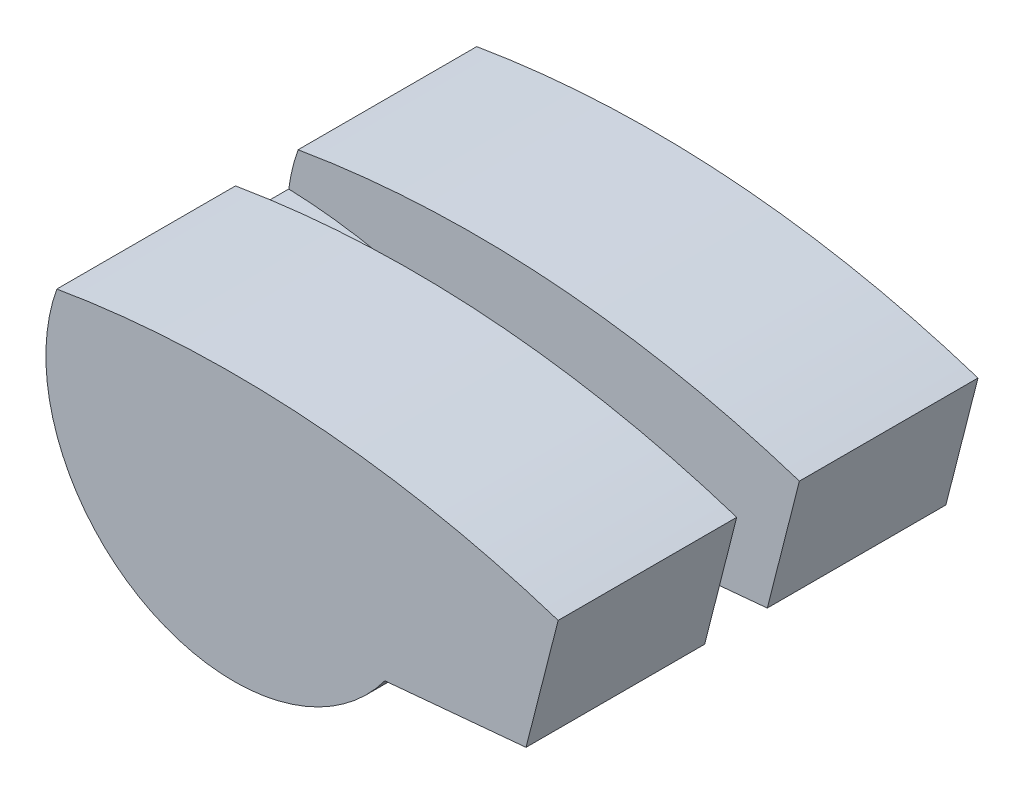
ISO-10303-21;
HEADER;
FILE_DESCRIPTION(('STEP AP214'),'2;1');
FILE_NAME('part.step','',(''),(''),'','','');
FILE_SCHEMA(('AUTOMOTIVE_DESIGN { 1 0 10303 214 1 1 1 1 }'));
ENDSEC;
DATA;
#1=APPLICATION_CONTEXT('core data for automotive mechanical design processes');
#2=APPLICATION_PROTOCOL_DEFINITION('international standard','automotive_design',2000,#1);
#3=PRODUCT_CONTEXT('',#1,'mechanical');
#4=PRODUCT('Part','Part','',(#3));
#5=PRODUCT_RELATED_PRODUCT_CATEGORY('part','',(#4));
#6=PRODUCT_DEFINITION_FORMATION('','',#4);
#7=PRODUCT_DEFINITION_CONTEXT('part definition',#1,'design');
#8=PRODUCT_DEFINITION('design','',#6,#7);
#9=PRODUCT_DEFINITION_SHAPE('','',#8);
#10=(LENGTH_UNIT() NAMED_UNIT(*) SI_UNIT(.MILLI.,.METRE.));
#11=(NAMED_UNIT(*) PLANE_ANGLE_UNIT() SI_UNIT($,.RADIAN.));
#12=(NAMED_UNIT(*) SI_UNIT($,.STERADIAN.) SOLID_ANGLE_UNIT());
#13=UNCERTAINTY_MEASURE_WITH_UNIT(LENGTH_MEASURE(1.E-05),#10,'distance_accuracy_value','');
#14=(GEOMETRIC_REPRESENTATION_CONTEXT(3) GLOBAL_UNCERTAINTY_ASSIGNED_CONTEXT((#13)) GLOBAL_UNIT_ASSIGNED_CONTEXT((#10,
#11,#12)) REPRESENTATION_CONTEXT('',''));
#15=CARTESIAN_POINT('',(0.,0.,0.));
#16=DIRECTION('',(0.,0.,1.));
#17=DIRECTION('',(1.,0.,0.));
#18=AXIS2_PLACEMENT_3D('',#15,#16,#17);
#19=CARTESIAN_POINT('',(0.,0.,3.35));
#20=DIRECTION('',(0.,0.,-1.));
#21=DIRECTION('',(-1.,0.,0.));
#22=AXIS2_PLACEMENT_3D('',#19,#20,#21);
#23=CYLINDRICAL_SURFACE('',#22,3.00000000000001);
#24=CARTESIAN_POINT('',(0.,0.,-0.5));
#25=DIRECTION('',(0.,0.,1.));
#26=DIRECTION('',(1.,0.,0.));
#27=AXIS2_PLACEMENT_3D('',#24,#25,#26);
#28=CIRCLE('',#27,3.00000000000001);
#29=CARTESIAN_POINT('',(-2.82484284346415,1.0100806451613,-0.5));
#30=VERTEX_POINT('',#29);
#31=CARTESIAN_POINT('',(-2.97415390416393,0.392948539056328,-0.5));
#32=VERTEX_POINT('',#31);
#33=EDGE_CURVE('E485',#30,#32,#28,.T.);
#34=ORIENTED_EDGE('',*,*,#33,.F.);
#35=DIRECTION('',(0.,0.,-1.));
#36=VECTOR('',#35,1.);
#37=CARTESIAN_POINT('',(-2.82484284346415,1.01008064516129,3.35));
#38=LINE('',#37,#36);
#39=CARTESIAN_POINT('',(-2.82484284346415,1.01008064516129,-3.35));
#40=VERTEX_POINT('',#39);
#41=EDGE_CURVE('E466',#30,#40,#38,.T.);
#42=ORIENTED_EDGE('',*,*,#41,.T.);
#43=CARTESIAN_POINT('',(0.,0.,-3.35));
#44=DIRECTION('',(0.,0.,1.));
#45=DIRECTION('',(1.,0.,0.));
#46=AXIS2_PLACEMENT_3D('',#43,#44,#45);
#47=CIRCLE('',#46,3.00000000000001);
#48=CARTESIAN_POINT('',(2.40937388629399,-1.78743320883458,-3.35));
#49=VERTEX_POINT('',#48);
#50=EDGE_CURVE('E482',#40,#49,#47,.T.);
#51=ORIENTED_EDGE('',*,*,#50,.T.);
#52=DIRECTION('',(0.,0.,-1.));
#53=VECTOR('',#52,1.);
#54=CARTESIAN_POINT('',(2.40937388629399,-1.78743320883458,3.35));
#55=LINE('',#54,#53);
#56=CARTESIAN_POINT('',(2.40937388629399,-1.78743320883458,-0.5));
#57=VERTEX_POINT('',#56);
#58=EDGE_CURVE('E449',#57,#49,#55,.T.);
#59=ORIENTED_EDGE('',*,*,#58,.F.);
#60=DIRECTION('',(0.,0.,1.));
#61=VECTOR('',#60,1.);
#62=CARTESIAN_POINT('',(2.40937388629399,-1.78743320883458,-0.5));
#63=LINE('',#62,#61);
#64=CARTESIAN_POINT('',(2.40937388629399,-1.78743320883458,0.5));
#65=VERTEX_POINT('',#64);
#66=EDGE_CURVE('E426',#57,#65,#63,.T.);
#67=ORIENTED_EDGE('',*,*,#66,.T.);
#68=CARTESIAN_POINT('',(2.40937388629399,-1.78743320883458,3.35));
#69=VERTEX_POINT('',#68);
#70=EDGE_CURVE('E447',#69,#65,#55,.T.);
#71=ORIENTED_EDGE('',*,*,#70,.F.);
#72=CARTESIAN_POINT('',(0.,0.,3.35));
#73=DIRECTION('',(0.,0.,1.));
#74=DIRECTION('',(1.,0.,0.));
#75=AXIS2_PLACEMENT_3D('',#72,#73,#74);
#76=CIRCLE('',#75,3.00000000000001);
#77=CARTESIAN_POINT('',(-2.82484284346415,1.01008064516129,3.35));
#78=VERTEX_POINT('',#77);
#79=EDGE_CURVE('E471',#78,#69,#76,.T.);
#80=ORIENTED_EDGE('',*,*,#79,.F.);
#81=CARTESIAN_POINT('',(-2.82484284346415,1.01008064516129,0.5));
#82=VERTEX_POINT('',#81);
#83=EDGE_CURVE('E463',#78,#82,#38,.T.);
#84=ORIENTED_EDGE('',*,*,#83,.T.);
#85=CARTESIAN_POINT('',(0.,0.,0.5));
#86=DIRECTION('',(0.,0.,1.));
#87=DIRECTION('',(1.,0.,0.));
#88=AXIS2_PLACEMENT_3D('',#85,#86,#87);
#89=CIRCLE('',#88,3.00000000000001);
#90=CARTESIAN_POINT('',(-2.97415390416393,0.392948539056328,0.5));
#91=VERTEX_POINT('',#90);
#92=EDGE_CURVE('E365',#82,#91,#89,.T.);
#93=ORIENTED_EDGE('',*,*,#92,.T.);
#94=DIRECTION('',(0.,0.,1.));
#95=VECTOR('',#94,1.);
#96=CARTESIAN_POINT('',(-2.97415390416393,0.392948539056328,0.));
#97=LINE('',#96,#95);
#98=EDGE_CURVE('E429',#91,#32,#97,.F.);
#99=ORIENTED_EDGE('',*,*,#98,.T.);
#100=EDGE_LOOP('',(#34,#42,#51,#59,#67,#71,#80,#84,#93,#99));
#101=FACE_BOUND('',#100,.T.);
#102=ADVANCED_FACE('F351',(#101),#23,.T.);
#103=CARTESIAN_POINT('',(2.40937388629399,-1.78743320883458,3.35));
#104=DIRECTION('',(-0.0912073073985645,0.995831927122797,0.));
#105=DIRECTION('',(-0.995831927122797,-0.0912073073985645,0.));
#106=AXIS2_PLACEMENT_3D('',#103,#104,#105);
#107=PLANE('',#106);
#108=DIRECTION('',(0.995831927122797,0.0912073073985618,0.));
#109=VECTOR('',#108,1.);
#110=CARTESIAN_POINT('',(2.40937388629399,-1.78743320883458,-0.5));
#111=LINE('',#110,#109);
#112=CARTESIAN_POINT('',(4.66246004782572,-1.58107517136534,-0.5));
#113=VERTEX_POINT('',#112);
#114=EDGE_CURVE('E450',#57,#113,#111,.T.);
#115=ORIENTED_EDGE('',*,*,#114,.F.);
#116=ORIENTED_EDGE('',*,*,#58,.T.);
#117=DIRECTION('',(0.995831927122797,0.0912073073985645,0.));
#118=VECTOR('',#117,1.);
#119=CARTESIAN_POINT('',(2.40937388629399,-1.78743320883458,-3.35));
#120=LINE('',#119,#118);
#121=CARTESIAN_POINT('',(4.66246004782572,-1.58107517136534,-3.35));
#122=VERTEX_POINT('',#121);
#123=EDGE_CURVE('E479',#49,#122,#120,.T.);
#124=ORIENTED_EDGE('',*,*,#123,.T.);
#125=DIRECTION('',(0.,0.,-1.));
#126=VECTOR('',#125,1.);
#127=CARTESIAN_POINT('',(4.66246004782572,-1.58107517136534,3.35));
#128=LINE('',#127,#126);
#129=EDGE_CURVE('E458',#113,#122,#128,.T.);
#130=ORIENTED_EDGE('',*,*,#129,.F.);
#131=EDGE_LOOP('',(#115,#116,#124,#130));
#132=FACE_BOUND('',#131,.T.);
#133=ADVANCED_FACE('F515',(#132),#107,.F.);
#134=CARTESIAN_POINT('',(4.66246004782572,-1.58107517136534,3.35));
#135=DIRECTION('',(-0.969020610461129,0.246979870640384,0.));
#136=DIRECTION('',(-0.246979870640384,-0.969020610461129,0.));
#137=AXIS2_PLACEMENT_3D('',#134,#135,#136);
#138=PLANE('',#137);
#139=DIRECTION('',(0.246979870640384,0.969020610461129,0.));
#140=VECTOR('',#139,1.);
#141=CARTESIAN_POINT('',(4.66246004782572,-1.58107517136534,-0.5));
#142=LINE('',#141,#140);
#143=CARTESIAN_POINT('',(5.17515715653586,0.4304817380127,-0.5));
#144=VERTEX_POINT('',#143);
#145=EDGE_CURVE('E487',#113,#144,#142,.T.);
#146=ORIENTED_EDGE('',*,*,#145,.F.);
#147=ORIENTED_EDGE('',*,*,#129,.T.);
#148=DIRECTION('',(0.246979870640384,0.969020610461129,0.));
#149=VECTOR('',#148,1.);
#150=CARTESIAN_POINT('',(4.66246004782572,-1.58107517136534,-3.35));
#151=LINE('',#150,#149);
#152=CARTESIAN_POINT('',(5.17515715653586,0.430481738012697,-3.35));
#153=VERTEX_POINT('',#152);
#154=EDGE_CURVE('E476',#122,#153,#151,.T.);
#155=ORIENTED_EDGE('',*,*,#154,.T.);
#156=DIRECTION('',(0.,0.,-1.));
#157=VECTOR('',#156,1.);
#158=CARTESIAN_POINT('',(5.17515715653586,0.430481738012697,3.35));
#159=LINE('',#158,#157);
#160=EDGE_CURVE('E462',#144,#153,#159,.T.);
#161=ORIENTED_EDGE('',*,*,#160,.F.);
#162=EDGE_LOOP('',(#146,#147,#155,#161));
#163=FACE_BOUND('',#162,.T.);
#164=ADVANCED_FACE('F519',(#163),#138,.F.);
#165=CARTESIAN_POINT('',(0.,-15.5,3.35));
#166=DIRECTION('',(0.,0.,-1.));
#167=DIRECTION('',(-1.,0.,0.));
#168=AXIS2_PLACEMENT_3D('',#165,#166,#167);
#169=CYLINDRICAL_SURFACE('',#168,16.75);
#170=CARTESIAN_POINT('',(0.,-15.5,-0.5));
#171=DIRECTION('',(0.,0.,1.));
#172=DIRECTION('',(1.,0.,0.));
#173=AXIS2_PLACEMENT_3D('',#170,#171,#172);
#174=CIRCLE('',#173,16.75);
#175=EDGE_CURVE('E11',#144,#30,#174,.T.);
#176=ORIENTED_EDGE('',*,*,#175,.F.);
#177=ORIENTED_EDGE('',*,*,#160,.T.);
#178=CARTESIAN_POINT('',(0.,-15.5,-3.35));
#179=DIRECTION('',(0.,0.,1.));
#180=DIRECTION('',(1.,0.,0.));
#181=AXIS2_PLACEMENT_3D('',#178,#179,#180);
#182=CIRCLE('',#181,16.75);
#183=EDGE_CURVE('E473',#153,#40,#182,.T.);
#184=ORIENTED_EDGE('',*,*,#183,.T.);
#185=ORIENTED_EDGE('',*,*,#41,.F.);
#186=EDGE_LOOP('',(#176,#177,#184,#185));
#187=FACE_BOUND('',#186,.T.);
#188=ADVANCED_FACE('F513',(#187),#169,.T.);
#189=ORIENTED_EDGE('',*,*,#70,.T.);
#190=DIRECTION('',(0.995831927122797,0.0912073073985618,0.));
#191=VECTOR('',#190,1.);
#192=CARTESIAN_POINT('',(2.40937388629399,-1.78743320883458,0.5));
#193=LINE('',#192,#191);
#194=CARTESIAN_POINT('',(4.66246004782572,-1.58107517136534,0.5));
#195=VERTEX_POINT('',#194);
#196=EDGE_CURVE('E430',#65,#195,#193,.T.);
#197=ORIENTED_EDGE('',*,*,#196,.T.);
#198=CARTESIAN_POINT('',(4.66246004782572,-1.58107517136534,3.35));
#199=VERTEX_POINT('',#198);
#200=EDGE_CURVE('E455',#199,#195,#128,.T.);
#201=ORIENTED_EDGE('',*,*,#200,.F.);
#202=DIRECTION('',(0.995831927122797,0.0912073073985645,0.));
#203=VECTOR('',#202,1.);
#204=CARTESIAN_POINT('',(2.40937388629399,-1.78743320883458,3.35));
#205=LINE('',#204,#203);
#206=EDGE_CURVE('E453',#69,#199,#205,.T.);
#207=ORIENTED_EDGE('',*,*,#206,.F.);
#208=EDGE_LOOP('',(#189,#197,#201,#207));
#209=FACE_BOUND('',#208,.T.);
#210=ADVANCED_FACE('F452',(#209),#107,.F.);
#211=ORIENTED_EDGE('',*,*,#200,.T.);
#212=DIRECTION('',(0.246979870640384,0.969020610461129,0.));
#213=VECTOR('',#212,1.);
#214=CARTESIAN_POINT('',(4.66246004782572,-1.58107517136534,0.5));
#215=LINE('',#214,#213);
#216=CARTESIAN_POINT('',(5.17515715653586,0.4304817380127,0.5));
#217=VERTEX_POINT('',#216);
#218=EDGE_CURVE('E435',#195,#217,#215,.T.);
#219=ORIENTED_EDGE('',*,*,#218,.T.);
#220=CARTESIAN_POINT('',(5.17515715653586,0.430481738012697,3.35));
#221=VERTEX_POINT('',#220);
#222=EDGE_CURVE('E459',#221,#217,#159,.T.);
#223=ORIENTED_EDGE('',*,*,#222,.F.);
#224=DIRECTION('',(0.246979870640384,0.969020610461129,0.));
#225=VECTOR('',#224,1.);
#226=CARTESIAN_POINT('',(4.66246004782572,-1.58107517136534,3.35));
#227=LINE('',#226,#225);
#228=EDGE_CURVE('E468',#199,#221,#227,.T.);
#229=ORIENTED_EDGE('',*,*,#228,.F.);
#230=EDGE_LOOP('',(#211,#219,#223,#229));
#231=FACE_BOUND('',#230,.T.);
#232=ADVANCED_FACE('F500',(#231),#138,.F.);
#233=ORIENTED_EDGE('',*,*,#222,.T.);
#234=CARTESIAN_POINT('',(0.,-15.5,0.5));
#235=DIRECTION('',(0.,0.,1.));
#236=DIRECTION('',(1.,0.,0.));
#237=AXIS2_PLACEMENT_3D('',#234,#235,#236);
#238=CIRCLE('',#237,16.75);
#239=EDGE_CURVE('E358',#217,#82,#238,.T.);
#240=ORIENTED_EDGE('',*,*,#239,.T.);
#241=ORIENTED_EDGE('',*,*,#83,.F.);
#242=CARTESIAN_POINT('',(0.,-15.5,3.35));
#243=DIRECTION('',(0.,0.,1.));
#244=DIRECTION('',(1.,0.,0.));
#245=AXIS2_PLACEMENT_3D('',#242,#243,#244);
#246=CIRCLE('',#245,16.75);
#247=EDGE_CURVE('E373',#221,#78,#246,.T.);
#248=ORIENTED_EDGE('',*,*,#247,.F.);
#249=EDGE_LOOP('',(#233,#240,#241,#248));
#250=FACE_BOUND('',#249,.T.);
#251=ADVANCED_FACE('F497',(#250),#169,.T.);
#252=CARTESIAN_POINT('',(0.,0.,3.35));
#253=DIRECTION('',(0.,0.,1.));
#254=DIRECTION('',(1.,0.,0.));
#255=AXIS2_PLACEMENT_3D('',#252,#253,#254);
#256=PLANE('',#255);
#257=ORIENTED_EDGE('',*,*,#79,.T.);
#258=ORIENTED_EDGE('',*,*,#206,.T.);
#259=ORIENTED_EDGE('',*,*,#228,.T.);
#260=ORIENTED_EDGE('',*,*,#247,.T.);
#261=EDGE_LOOP('',(#257,#258,#259,#260));
#262=FACE_BOUND('',#261,.T.);
#263=ADVANCED_FACE('F502',(#262),#256,.T.);
#264=CARTESIAN_POINT('',(0.,0.,-3.35));
#265=DIRECTION('',(0.,0.,1.));
#266=DIRECTION('',(1.,0.,0.));
#267=AXIS2_PLACEMENT_3D('',#264,#265,#266);
#268=PLANE('',#267);
#269=ORIENTED_EDGE('',*,*,#50,.F.);
#270=ORIENTED_EDGE('',*,*,#183,.F.);
#271=ORIENTED_EDGE('',*,*,#154,.F.);
#272=ORIENTED_EDGE('',*,*,#123,.F.);
#273=EDGE_LOOP('',(#269,#270,#271,#272));
#274=FACE_BOUND('',#273,.T.);
#275=ADVANCED_FACE('F504',(#274),#268,.F.);
#276=CARTESIAN_POINT('',(-3.27028389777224,-8.07457880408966,-0.5));
#277=DIRECTION('',(0.,0.,1.));
#278=DIRECTION('',(1.,0.,0.));
#279=AXIS2_PLACEMENT_3D('',#276,#277,#278);
#280=CYLINDRICAL_SURFACE('',#279,8.47270395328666);
#281=CARTESIAN_POINT('',(-3.27028389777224,-8.07457880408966,0.5));
#282=DIRECTION('',(0.,0.,-1.));
#283=DIRECTION('',(1.,0.,0.));
#284=AXIS2_PLACEMENT_3D('',#281,#282,#283);
#285=CIRCLE('',#284,8.47270395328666);
#286=EDGE_CURVE('E421',#91,#65,#285,.T.);
#287=ORIENTED_EDGE('',*,*,#286,.T.);
#288=ORIENTED_EDGE('',*,*,#66,.F.);
#289=CARTESIAN_POINT('',(-3.27028389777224,-8.07457880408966,-0.5));
#290=DIRECTION('',(0.,0.,-1.));
#291=DIRECTION('',(1.,0.,0.));
#292=AXIS2_PLACEMENT_3D('',#289,#290,#291);
#293=CIRCLE('',#292,8.47270395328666);
#294=EDGE_CURVE('E440',#32,#57,#293,.T.);
#295=ORIENTED_EDGE('',*,*,#294,.F.);
#296=ORIENTED_EDGE('',*,*,#98,.F.);
#297=EDGE_LOOP('',(#287,#288,#295,#296));
#298=FACE_BOUND('',#297,.T.);
#299=ADVANCED_FACE('F423',(#298),#280,.T.);
#300=CARTESIAN_POINT('',(0.,-15.5,-0.5));
#301=DIRECTION('',(0.,0.,1.));
#302=DIRECTION('',(1.,0.,0.));
#303=AXIS2_PLACEMENT_3D('',#300,#301,#302);
#304=PLANE('',#303);
#305=ORIENTED_EDGE('',*,*,#33,.T.);
#306=ORIENTED_EDGE('',*,*,#294,.T.);
#307=ORIENTED_EDGE('',*,*,#114,.T.);
#308=ORIENTED_EDGE('',*,*,#145,.T.);
#309=ORIENTED_EDGE('',*,*,#175,.T.);
#310=EDGE_LOOP('',(#305,#306,#307,#308,#309));
#311=FACE_BOUND('',#310,.T.);
#312=ADVANCED_FACE('F493',(#311),#304,.T.);
#313=CARTESIAN_POINT('',(0.,-15.5,0.5));
#314=DIRECTION('',(0.,0.,1.));
#315=DIRECTION('',(1.,0.,0.));
#316=AXIS2_PLACEMENT_3D('',#313,#314,#315);
#317=PLANE('',#316);
#318=ORIENTED_EDGE('',*,*,#239,.F.);
#319=ORIENTED_EDGE('',*,*,#218,.F.);
#320=ORIENTED_EDGE('',*,*,#196,.F.);
#321=ORIENTED_EDGE('',*,*,#286,.F.);
#322=ORIENTED_EDGE('',*,*,#92,.F.);
#323=EDGE_LOOP('',(#318,#319,#320,#321,#322));
#324=FACE_BOUND('',#323,.T.);
#325=ADVANCED_FACE('F433',(#324),#317,.F.);
#326=CLOSED_SHELL('',(#102,#133,#164,#188,#210,#232,#251,#263,#275,#299,#312,#325));
#327=MANIFOLD_SOLID_BREP('B2',#326);
#328=ADVANCED_BREP_SHAPE_REPRESENTATION('',(#18,#327),#14);
#329=SHAPE_DEFINITION_REPRESENTATION(#9,#328);
ENDSEC;
END-ISO-10303-21;
